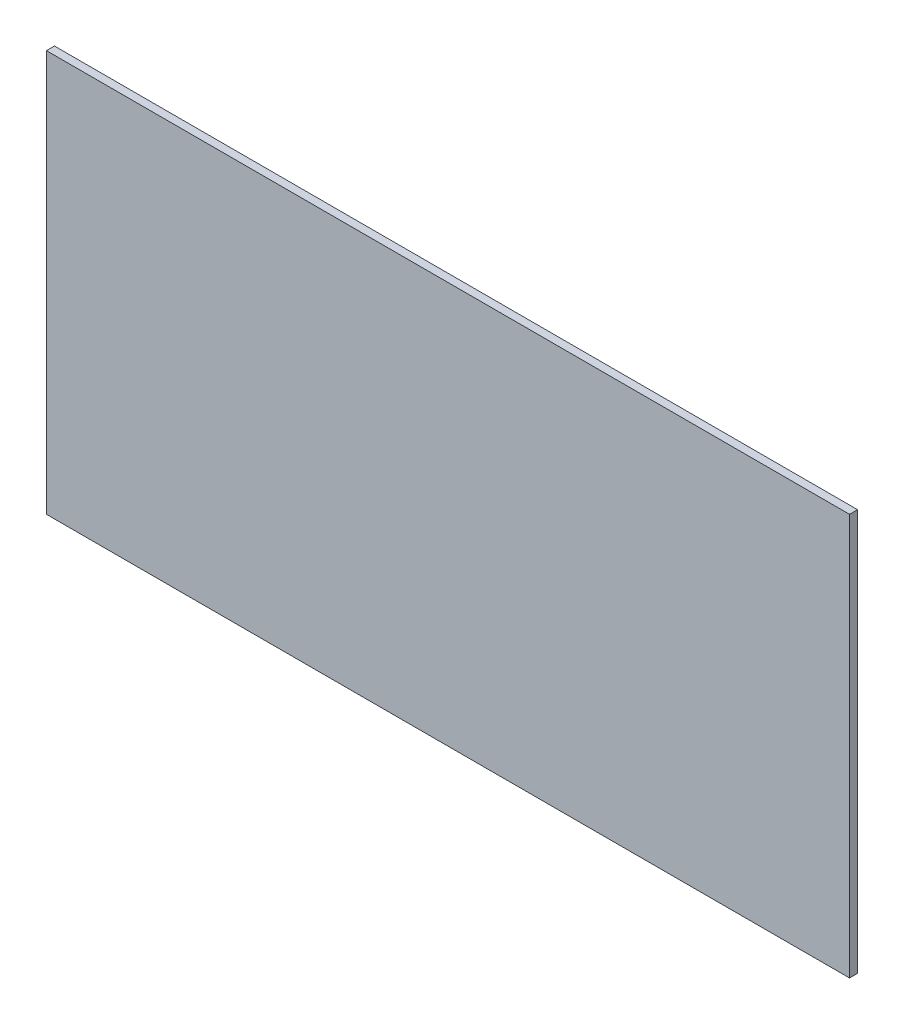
from build123d import *

# Parameters (mm, degrees)
SKIZZE1_W               = 200
SKIZZE1_H               = 100
LINEAR_AUSTRAGEN1_DEPTH = 2


with BuildPart() as part:
    # Skizze1 → Linear austragen1 (new body)
    with BuildSketch(Plane.XY):
        with Locations((100, 50)):
            Rectangle(SKIZZE1_W, SKIZZE1_H)
    extrude(amount=LINEAR_AUSTRAGEN1_DEPTH)


solid = part.part
